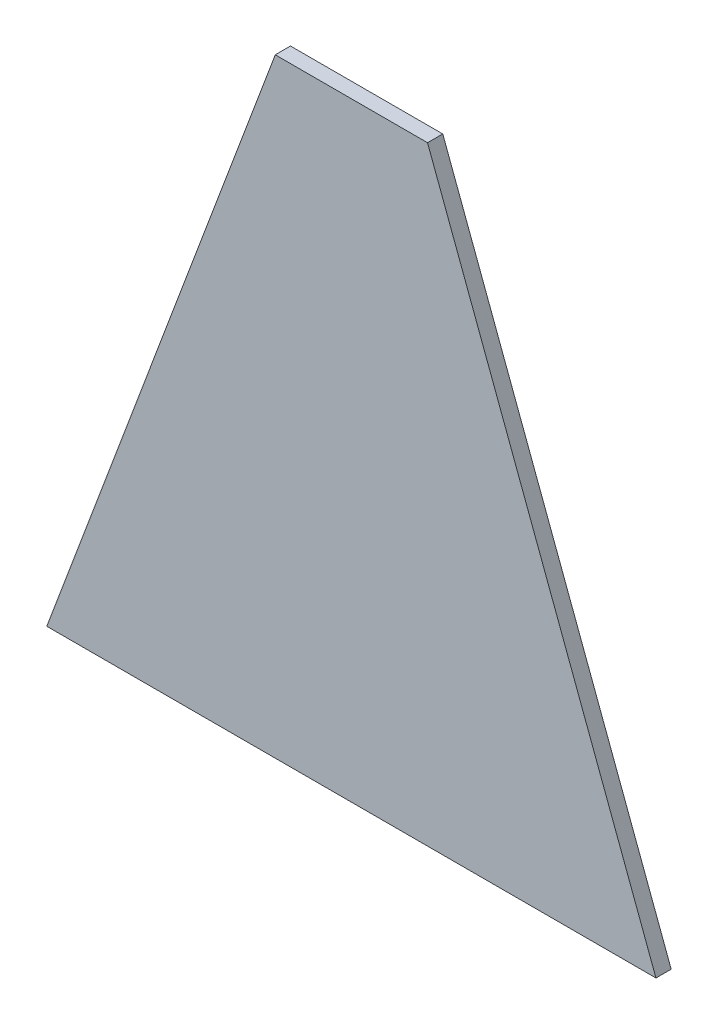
from build123d import *

# Parameters (mm, degrees)
BOSS_EXTRUDE1_DEPTH = 2


with BuildPart() as part:
    # Sketch1 → Boss-Extrude1 (new body)
    with BuildSketch(Plane.XY):
        Polygon((-11.892432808, 0), (8.107567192, 0), (38.107567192, -80), (-41.892432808, -80), align=None)
    extrude(amount=BOSS_EXTRUDE1_DEPTH)


solid = part.part
